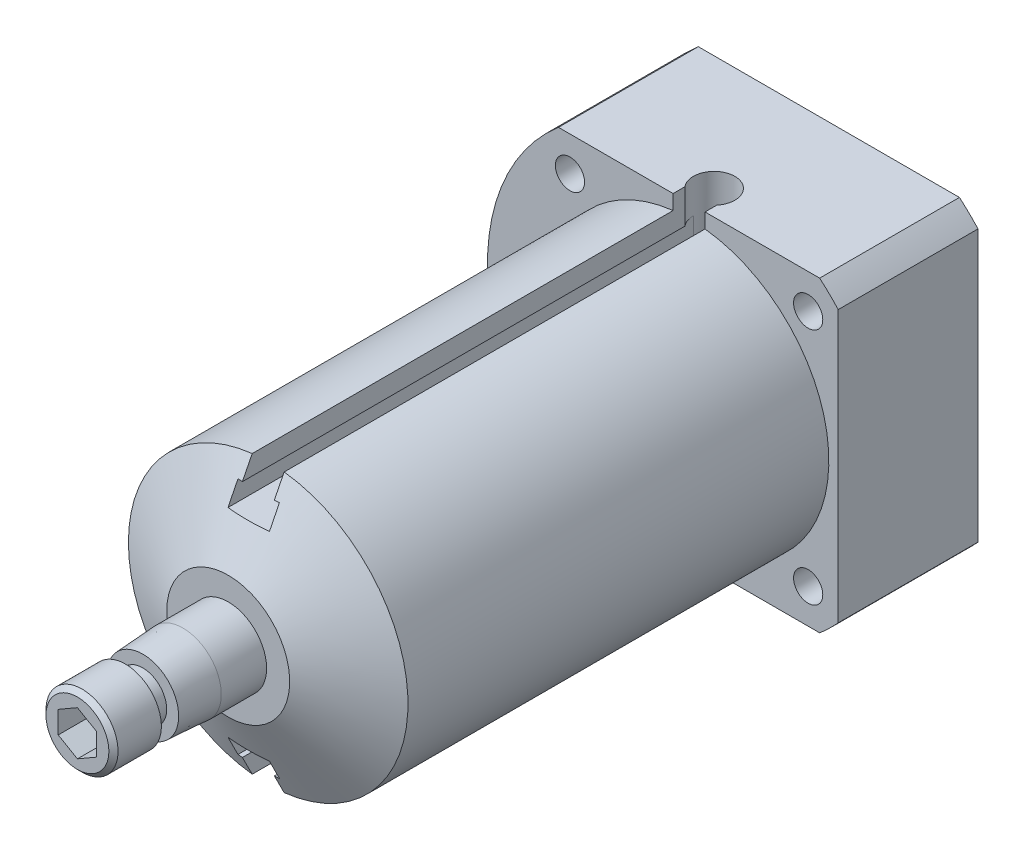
from build123d import *

# Parameters (mm, degrees)
EXTRUDE1_DEPTH     = 99.314
HOLE1_D            = 6.5278
HOLE1_DEPTH        = 19.05
HOLE1_TIP          = 1.961148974
HOLE2_D            = 4.826
CIRPATTERN1_COUNT  = 4
CUT_EXTRUDE1_DEPTH = 80.3402
CUT_EXTRUDE2_DEPTH = 60.325
CUT_EXTRUDE3_REACH = 130.698
SKETCH14_R         = 3.429
CUT_EXTRUDE4_REACH = 130.698
SKETCH15_R         = 3.429
CUT_EXTRUDE5_DEPTH = 4.7498


with BuildPart() as part:
    # Sketch1 → Extrude1 (new body)
    with BuildSketch(Plane.XY):
        with BuildLine():
            Line((-21.592334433, 25.4), (21.592334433, 25.4))
            ThreePointArc((21.592334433, 25.4), (23.175492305, 23.964253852), (24.6634, 22.430015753))
            Line((24.6634, 22.430015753), (24.6634, -22.430015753))
            ThreePointArc((24.6634, -22.430015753), (23.175492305, -23.964253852), (21.592334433, -25.4))
            Line((21.592334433, -25.4), (-21.592334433, -25.4))
            ThreePointArc((-21.592334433, -25.4), (-33.3375, 0), (-21.592334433, 25.4))
        make_face()
    extrude(amount=EXTRUDE1_DEPTH)

    # Sketch2 → Cut-Revolve1 (revolve, cut)
    with BuildSketch(Plane(origin=(0, 0, 0), x_dir=(1, 0, 0), z_dir=(0, 1, 0))):
        Polygon((-33.3375, -23.114), (-23.114, -23.114), (-23.114, -92.71), (-10.16, -99.314), (-33.3375, -99.314), align=None)
    revolve(axis=Axis((0, 0, 0), (0, 0, 1)), mode=Mode.SUBTRACT)

    # Sketch4 → Revolve1 (revolve)
    with BuildSketch(Plane(origin=(0, 0, 0), x_dir=(1, 0, 0), z_dir=(0, 1, 0))):
        Polygon((-6.34365, -99.314), (-6.34365, -106.807), (-5.93725, -113.451581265), (0, -113.451581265), (0, -99.314), align=None)
    revolve(axis=Axis((0, 0, 0), (0, 0, 1)))

    # Hole1
    with Locations(Plane.XY.offset(113.451581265)):
        with Locations((0, 0)):
            Hole(HOLE1_D / 2, depth=HOLE1_DEPTH)
            with Locations((0, 0, -(HOLE1_DEPTH + HOLE1_TIP / 2))):  # 118° drill point
                Cone(0, HOLE1_D / 2, HOLE1_TIP, mode=Mode.SUBTRACT)

    # Hole2 (through all)
    with Locations(Plane.XY.offset(23.114)):
        with Locations((19.693701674, 19.693701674)):
            hole2 = Hole(HOLE2_D / 2)

    # CirPattern1: Hole2 ×4 about axis
    cirpattern1_axis = Axis((0, 0, 0), (0, 0, 1))
    for i in range(1, CIRPATTERN1_COUNT):
        add(hole2.rotate(cirpattern1_axis, i * 360 / CIRPATTERN1_COUNT), mode=Mode.SUBTRACT)

    # Sketch11 → Cut-Revolve2 (revolve, cut)
    with BuildSketch(Plane(origin=(0, 0, 14.2748), x_dir=(-1, 0, 0), z_dir=(0, 0, -1))):
        Polygon((64.134914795, 34.502832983), (18.094479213, 13.033825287), (19.854937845, 9.258509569), (65.895373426, 30.727517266), align=None)
    cut_revolve2 = revolve(axis=Axis((0, 0, 14.2748), (-0.9063077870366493, 0.4226182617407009, 0)), mode=Mode.SUBTRACT)

    # Mirror1: Cut-Revolve2 across plane
    add(cut_revolve2.mirror(Plane.ZX), mode=Mode.SUBTRACT)

    # Sketch12 → Cut-Extrude1 (cut)
    with BuildSketch(Plane.XY.offset(99.314)):
        Polygon((-2.6416, 50.8), (-2.6416, 19.7485), (-3.429, 19.7485), (-3.429, 16.4465), (3.429, 16.4465), (3.429, 19.7485), (2.6416, 19.7485), (2.6416, 50.8), align=None)
    extrude(amount=-CUT_EXTRUDE1_DEPTH, mode=Mode.SUBTRACT)

    # Sketch13 → Cut-Extrude2 (cut)
    with BuildSketch(Plane.XY.offset(99.314)):
        Polygon((-3.429, -16.4465), (3.429, -16.4465), (3.429, -19.7485), (2.6416, -19.7485), (2.6416, -50.8), (-2.6416, -50.8), (-2.6416, -19.7485), (-3.429, -19.7485), align=None)
    extrude(amount=-CUT_EXTRUDE2_DEPTH, mode=Mode.SUBTRACT)

    # Cut-Extrude3: up to this face of the body (flat: up to its plane)
    cut_extrude3_end = Plane(part.part.faces().sort_by_distance((0, 16.4465, 57.511299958))[0])
    # Sketch14 → Cut-Extrude3 (cut, up to the picked face)
    with BuildSketch(Plane(origin=(0, 25.4, 0), x_dir=(1, 0, 0), z_dir=(0, 1, 0)), mode=Mode.PRIVATE) as cut_extrude3_sk1:
        with Locations((0, -18.9738)):
            Circle(SKETCH14_R)
    cut_extrude3_tool1 = split(extrude(cut_extrude3_sk1.sketch, amount=-CUT_EXTRUDE3_REACH, mode=Mode.PRIVATE), bisect_by=cut_extrude3_end, keep=Keep.BOTH, mode=Mode.PRIVATE)
    add(cut_extrude3_tool1.solids().sort_by(Axis((0, 25.4, 18.9738), (0, -1, 0)))[0], mode=Mode.SUBTRACT)

    # Cut-Extrude4: up to this face of the body (flat: up to its plane)
    cut_extrude4_end = Plane(part.part.faces().sort_by_distance((0, -16.4465, 67.518906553))[0])
    # Sketch15 → Cut-Extrude4 (cut, up to the picked face)
    with BuildSketch(Plane.XZ.offset(25.4), mode=Mode.PRIVATE) as cut_extrude4_sk1:
        with Locations((0, 38.989)):
            Circle(SKETCH15_R)
    cut_extrude4_tool1 = split(extrude(cut_extrude4_sk1.sketch, amount=-CUT_EXTRUDE4_REACH, mode=Mode.PRIVATE), bisect_by=cut_extrude4_end, keep=Keep.BOTH, mode=Mode.PRIVATE)
    add(cut_extrude4_tool1.solids().sort_by(Axis((0, -25.4, 38.989), (0, 1, 0)))[0], mode=Mode.SUBTRACT)

    # Sketch16 → Revolve2 (revolve)
    with BuildSketch(Plane(origin=(0, 0, 0), x_dir=(1, 0, 0), z_dir=(0, 1, 0))):
        Polygon((-3.9624, -113.451581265), (-3.9624, -116.332), (-5.9563, -116.332), (-5.9563, -123.4948), (-5.1943, -124.2568), (0, -124.2568), (0, -113.451581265), align=None)
    revolve(axis=Axis((0, 0, 0), (0, 0, 1)))

    # Sketch17 → Cut-Extrude5 (cut)
    with BuildSketch(Plane.XY.offset(124.2568)):
        Polygon((3.175, -1.833087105), (3.175, 1.833087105), (0, 3.666174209), (-3.175, 1.833087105), (-3.175, -1.833087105), (0, -3.666174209), align=None)
    extrude(amount=-CUT_EXTRUDE5_DEPTH, mode=Mode.SUBTRACT)


solid = part.part
